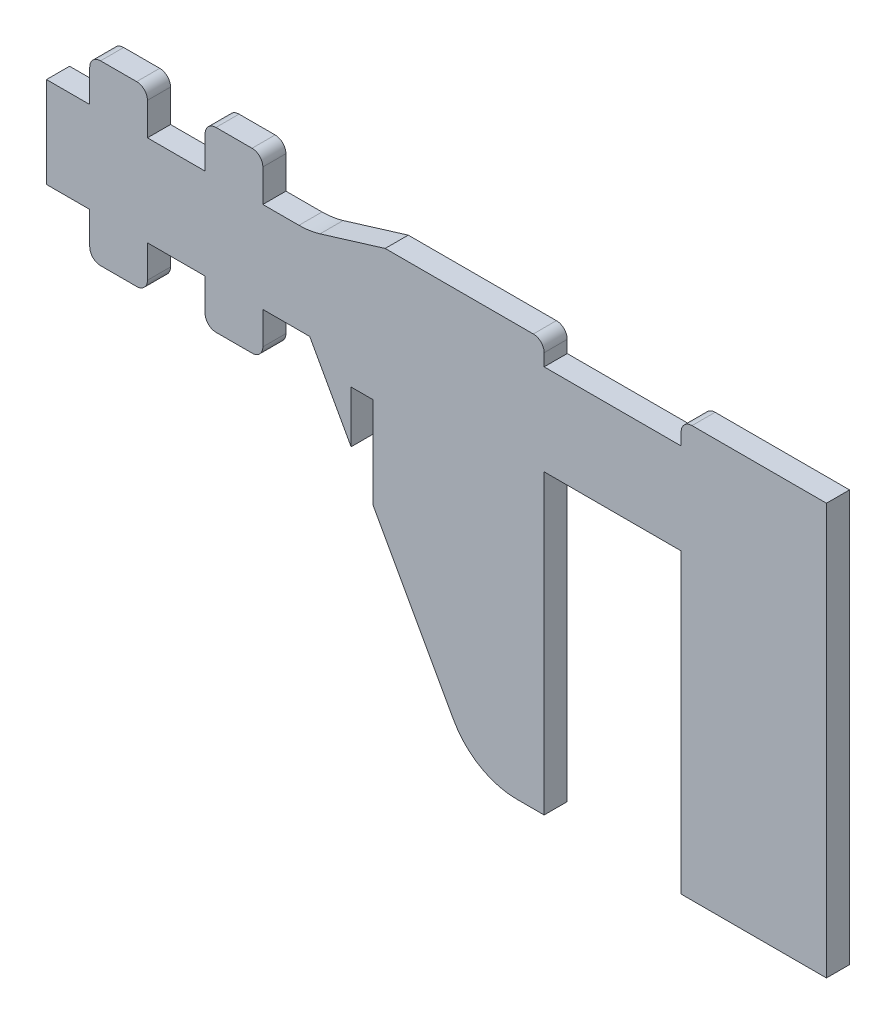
from build123d import *

# Parameters (mm, degrees)
BOSS_EXTRU_1_DEPTH      = 3.2
ESQUISSE2_W             = 19
ESQUISSE2_H             = 3.2
ENL_V_MAT_EXTRU_1_DEPTH = 90.954840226
CONG_2_R                = 10
ESQUISSE3_W             = 3
ESQUISSE3_H             = 40
ESQUISSE3_W_2           = 19
ESQUISSE3_H_2           = 50
ENL_V_MAT_EXTRU_2_DEPTH = 10
CONG_3_R                = 10
ESQUISSE4_W             = 19
ESQUISSE4_H             = 3.2
ENL_V_MAT_EXTRU_3_DEPTH = 10
ENL_V_MAT_EXTRU_4_DEPTH = 10
CONG_4_R                = 1.5


with BuildPart() as part:
    # Esquisse1 → Boss.-Extru.1 (new body)
    with BuildSketch(Plane.XY):
        Polygon((-28.239665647, 0), (-22.239665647, 0), (-22.239665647, -6), (-14.239665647, -6), (-14.239665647, 0), (-6.239665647, 0), (-6.239665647, -6), (1.760334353, -6), (1.760334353, 0), (8.260334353, 0), (31.052239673, -41.20692623), (79.897575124, -41.20692623), (79.897575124, 34.517996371), (8.260334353, 12.6), (1.760334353, 12.6), (1.760334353, 18.6), (-6.239665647, 18.6), (-6.239665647, 12.6), (-14.239665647, 12.6), (-14.239665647, 18.6), (-22.239665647, 18.6), (-22.239665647, 12.6), (-28.239665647, 12.6), align=None)
    extrude(amount=BOSS_EXTRU_1_DEPTH)

    # Esquisse2 → Enl_v. mat.-Extru.1 (cut, through all)
    with BuildSketch(Plane.XY.offset(3.2)):
        with Locations((50.257477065, 14.2)):
            Rectangle(ESQUISSE2_W, ESQUISSE2_H)
    extrude(amount=-ENL_V_MAT_EXTRU_1_DEPTH, mode=Mode.SUBTRACT)

    # Cong_2
    cong_2_edges = [part.edges().sort_by_distance(p)[0] for p in [
        (8.260334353, 12.6, 1.6),
    ]]
    fillet(cong_2_edges, radius=CONG_2_R)

    # Esquisse3 → Enl_v. mat.-Extru.2 (cut)
    with BuildSketch(Plane.XY.offset(3.2)):
        with Locations((15.5, -23.2)):
            Rectangle(ESQUISSE3_W, ESQUISSE3_H)
        with Locations((50.257477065, -28.2)):
            Rectangle(ESQUISSE3_W_2, ESQUISSE3_H_2)
    extrude(amount=-ENL_V_MAT_EXTRU_2_DEPTH, mode=Mode.SUBTRACT)

    # Cong_3
    cong_3_edges = [part.edges().sort_by_distance(p)[0] for p in [
        (79.897575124, 34.517996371, 1.6),
        (31.052239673, -41.20692623, 1.6),
    ]]
    fillet(cong_3_edges, radius=CONG_3_R)

    # Esquisse4 → Enl_v. mat.-Extru.3 (cut)
    with BuildSketch(Plane.XY.offset(3.2)):
        with Locations((50.257477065, -1.6)):
            Rectangle(ESQUISSE4_W, ESQUISSE4_H)
    extrude(amount=-ENL_V_MAT_EXTRU_3_DEPTH, mode=Mode.SUBTRACT)

    # Esquisse5 → Enl_v. mat.-Extru.4 (cut)
    with BuildSketch(Plane(origin=(0, 0, 0), x_dir=(-1, 0, 0), z_dir=(0, 0, -1))):
        Polygon((-40.757477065, 15.8), (-9.985317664, 15.8), (-16.7996782, 40.928966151), (-90.537161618, 47.031378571), (-94.707143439, 13.976644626), (-79.897575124, 15.8), (-59.757477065, 15.8), (-59.757477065, 12.6), (-40.757477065, 12.6), align=None)
    extrude(amount=-ENL_V_MAT_EXTRU_4_DEPTH, mode=Mode.SUBTRACT)

    # Cong_4
    cong_4_edges = [part.edges().sort_by_distance(p)[0] for p in [
        (-22.239665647, 18.6, 1.6),
        (-14.239665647, 18.6, 1.6),
        (-6.239665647, 18.6, 1.6),
        (1.760334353, 18.6, 1.6),
        (1.760334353, -6, 1.6),
        (-6.239665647, -6, 1.6),
        (-14.239665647, -6, 1.6),
        (-22.239665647, -6, 1.6),
        (40.757477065, 15.8, 1.6),
        (59.757477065, 15.8, 1.6),
    ]]
    fillet(cong_4_edges, radius=CONG_4_R)


solid = part.part
